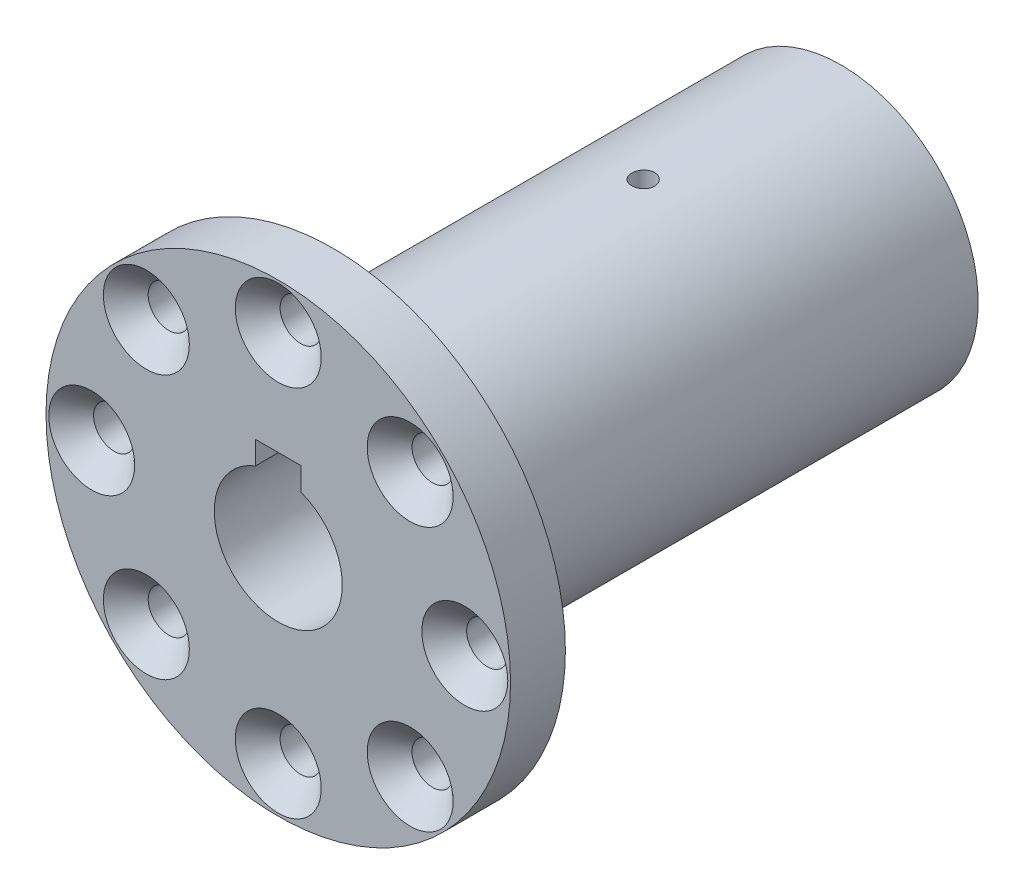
ISO-10303-21;
HEADER;
FILE_DESCRIPTION(('STEP AP214'),'2;1');
FILE_NAME('part.step','',(''),(''),'','','');
FILE_SCHEMA(('AUTOMOTIVE_DESIGN { 1 0 10303 214 1 1 1 1 }'));
ENDSEC;
DATA;
#1=APPLICATION_CONTEXT('core data for automotive mechanical design processes');
#2=APPLICATION_PROTOCOL_DEFINITION('international standard','automotive_design',2000,#1);
#3=PRODUCT_CONTEXT('',#1,'mechanical');
#4=PRODUCT('Part','Part','',(#3));
#5=PRODUCT_RELATED_PRODUCT_CATEGORY('part','',(#4));
#6=PRODUCT_DEFINITION_FORMATION('','',#4);
#7=PRODUCT_DEFINITION_CONTEXT('part definition',#1,'design');
#8=PRODUCT_DEFINITION('design','',#6,#7);
#9=PRODUCT_DEFINITION_SHAPE('','',#8);
#10=(LENGTH_UNIT() NAMED_UNIT(*) SI_UNIT(.MILLI.,.METRE.));
#11=(NAMED_UNIT(*) PLANE_ANGLE_UNIT() SI_UNIT($,.RADIAN.));
#12=(NAMED_UNIT(*) SI_UNIT($,.STERADIAN.) SOLID_ANGLE_UNIT());
#13=UNCERTAINTY_MEASURE_WITH_UNIT(LENGTH_MEASURE(1.E-05),#10,'distance_accuracy_value','');
#14=(GEOMETRIC_REPRESENTATION_CONTEXT(3) GLOBAL_UNCERTAINTY_ASSIGNED_CONTEXT((#13)) GLOBAL_UNIT_ASSIGNED_CONTEXT((#10,
#11,#12)) REPRESENTATION_CONTEXT('',''));
#15=CARTESIAN_POINT('',(0.,0.,0.));
#16=DIRECTION('',(0.,0.,1.));
#17=DIRECTION('',(1.,0.,0.));
#18=AXIS2_PLACEMENT_3D('',#15,#16,#17);
#19=CARTESIAN_POINT('',(0.,0.,61.54));
#20=DIRECTION('',(0.,0.,-1.));
#21=DIRECTION('',(-1.,0.,0.));
#22=AXIS2_PLACEMENT_3D('',#19,#20,#21);
#23=CYLINDRICAL_SURFACE('',#22,25.4);
#24=CARTESIAN_POINT('',(0.,0.,61.54));
#25=DIRECTION('',(0.,0.,-1.));
#26=DIRECTION('',(-1.,0.,0.));
#27=AXIS2_PLACEMENT_3D('',#24,#25,#26);
#28=CIRCLE('',#27,25.4);
#29=CARTESIAN_POINT('',(-25.4,0.,61.54));
#30=VERTEX_POINT('',#29);
#31=EDGE_CURVE('E11',#30,#30,#28,.T.);
#32=ORIENTED_EDGE('',*,*,#31,.T.);
#33=EDGE_LOOP('',(#32));
#34=FACE_BOUND('',#33,.T.);
#35=CARTESIAN_POINT('',(0.,0.,55.54));
#36=DIRECTION('',(0.,0.,-1.));
#37=DIRECTION('',(-1.,0.,0.));
#38=AXIS2_PLACEMENT_3D('',#35,#36,#37);
#39=CIRCLE('',#38,25.4);
#40=CARTESIAN_POINT('',(-25.4,0.,55.54));
#41=VERTEX_POINT('',#40);
#42=EDGE_CURVE('E41',#41,#41,#39,.T.);
#43=ORIENTED_EDGE('',*,*,#42,.F.);
#44=EDGE_LOOP('',(#43));
#45=FACE_BOUND('',#44,.T.);
#46=ADVANCED_FACE('F33',(#34,#45),#23,.T.);
#47=CARTESIAN_POINT('',(25.4,0.,61.54));
#48=DIRECTION('',(0.,0.,1.));
#49=DIRECTION('',(1.,0.,0.));
#50=AXIS2_PLACEMENT_3D('',#47,#48,#49);
#51=PLANE('',#50);
#52=CARTESIAN_POINT('',(0.,20.4,61.54));
#53=DIRECTION('',(0.,0.,1.));
#54=DIRECTION('',(1.,0.,0.));
#55=AXIS2_PLACEMENT_3D('',#52,#53,#54);
#56=CIRCLE('',#55,4.70000000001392);
#57=CARTESIAN_POINT('',(4.70000000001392,20.4,61.54));
#58=VERTEX_POINT('',#57);
#59=EDGE_CURVE('E368',#58,#58,#56,.T.);
#60=ORIENTED_EDGE('',*,*,#59,.F.);
#61=EDGE_LOOP('',(#60));
#62=FACE_BOUND('',#61,.T.);
#63=CARTESIAN_POINT('',(14.4249783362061,14.4249783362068,61.54));
#64=DIRECTION('',(0.,0.,1.));
#65=DIRECTION('',(1.,0.,0.));
#66=AXIS2_PLACEMENT_3D('',#63,#64,#65);
#67=CIRCLE('',#66,4.70000000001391);
#68=CARTESIAN_POINT('',(19.12497833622,14.4249783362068,61.54));
#69=VERTEX_POINT('',#68);
#70=EDGE_CURVE('E362',#69,#69,#67,.T.);
#71=ORIENTED_EDGE('',*,*,#70,.F.);
#72=EDGE_LOOP('',(#71));
#73=FACE_BOUND('',#72,.T.);
#74=CARTESIAN_POINT('',(20.4000000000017,1.73691033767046E-12,61.54));
#75=DIRECTION('',(0.,0.,1.));
#76=DIRECTION('',(1.,0.,0.));
#77=AXIS2_PLACEMENT_3D('',#74,#75,#76);
#78=CIRCLE('',#77,4.70000000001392);
#79=CARTESIAN_POINT('',(25.1000000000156,1.73691033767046E-12,61.54));
#80=VERTEX_POINT('',#79);
#81=EDGE_CURVE('E356',#80,#80,#78,.T.);
#82=ORIENTED_EDGE('',*,*,#81,.F.);
#83=EDGE_LOOP('',(#82));
#84=FACE_BOUND('',#83,.T.);
#85=CARTESIAN_POINT('',(14.4249783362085,-14.4249783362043,61.54));
#86=DIRECTION('',(0.,0.,1.));
#87=DIRECTION('',(1.,0.,0.));
#88=AXIS2_PLACEMENT_3D('',#85,#86,#87);
#89=CIRCLE('',#88,4.70000000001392);
#90=CARTESIAN_POINT('',(19.1249783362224,-14.4249783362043,61.54));
#91=VERTEX_POINT('',#90);
#92=EDGE_CURVE('E350',#91,#91,#89,.T.);
#93=ORIENTED_EDGE('',*,*,#92,.F.);
#94=EDGE_LOOP('',(#93));
#95=FACE_BOUND('',#94,.T.);
#96=CARTESIAN_POINT('',(3.47378376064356E-12,-20.4,61.54));
#97=DIRECTION('',(0.,0.,1.));
#98=DIRECTION('',(1.,0.,0.));
#99=AXIS2_PLACEMENT_3D('',#96,#97,#98);
#100=CIRCLE('',#99,4.70000000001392);
#101=CARTESIAN_POINT('',(4.70000000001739,-20.4,61.54));
#102=VERTEX_POINT('',#101);
#103=EDGE_CURVE('E344',#102,#102,#100,.T.);
#104=ORIENTED_EDGE('',*,*,#103,.F.);
#105=EDGE_LOOP('',(#104));
#106=FACE_BOUND('',#105,.T.);
#107=CARTESIAN_POINT('',(-14.4249783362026,-14.4249783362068,61.54));
#108=DIRECTION('',(0.,0.,1.));
#109=DIRECTION('',(1.,0.,0.));
#110=AXIS2_PLACEMENT_3D('',#107,#108,#109);
#111=CIRCLE('',#110,4.70000000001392);
#112=CARTESIAN_POINT('',(-9.72497833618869,-14.4249783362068,61.54));
#113=VERTEX_POINT('',#112);
#114=EDGE_CURVE('E338',#113,#113,#111,.T.);
#115=ORIENTED_EDGE('',*,*,#114,.F.);
#116=EDGE_LOOP('',(#115));
#117=FACE_BOUND('',#116,.T.);
#118=CARTESIAN_POINT('',(-20.3999999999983,-1.73940861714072E-12,61.54));
#119=DIRECTION('',(0.,0.,1.));
#120=DIRECTION('',(1.,0.,0.));
#121=AXIS2_PLACEMENT_3D('',#118,#119,#120);
#122=CIRCLE('',#121,4.70000000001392);
#123=CARTESIAN_POINT('',(-15.6999999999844,-1.73940861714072E-12,61.54));
#124=VERTEX_POINT('',#123);
#125=EDGE_CURVE('E332',#124,#124,#122,.T.);
#126=ORIENTED_EDGE('',*,*,#125,.F.);
#127=EDGE_LOOP('',(#126));
#128=FACE_BOUND('',#127,.T.);
#129=CARTESIAN_POINT('',(-14.4249783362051,14.4249783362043,61.54));
#130=DIRECTION('',(0.,0.,1.));
#131=DIRECTION('',(1.,0.,0.));
#132=AXIS2_PLACEMENT_3D('',#129,#130,#131);
#133=CIRCLE('',#132,4.70000000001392);
#134=CARTESIAN_POINT('',(-9.72497833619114,14.4249783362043,61.54));
#135=VERTEX_POINT('',#134);
#136=EDGE_CURVE('E260',#135,#135,#133,.T.);
#137=ORIENTED_EDGE('',*,*,#136,.F.);
#138=EDGE_LOOP('',(#137));
#139=FACE_BOUND('',#138,.T.);
#140=CARTESIAN_POINT('',(0.,0.,61.54));
#141=DIRECTION('',(0.,0.,-1.));
#142=DIRECTION('',(-1.,0.,0.));
#143=AXIS2_PLACEMENT_3D('',#140,#141,#142);
#144=CIRCLE('',#143,7.);
#145=CARTESIAN_POINT('',(2.5,6.53834841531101,61.54));
#146=VERTEX_POINT('',#145);
#147=CARTESIAN_POINT('',(-2.5,6.53834841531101,61.54));
#148=VERTEX_POINT('',#147);
#149=EDGE_CURVE('E84',#146,#148,#144,.T.);
#150=ORIENTED_EDGE('',*,*,#149,.T.);
#151=DIRECTION('',(0.,1.,0.));
#152=VECTOR('',#151,1.);
#153=CARTESIAN_POINT('',(-2.5,6.53834841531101,61.54));
#154=LINE('',#153,#152);
#155=CARTESIAN_POINT('',(-2.5,9.05849989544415,61.54));
#156=VERTEX_POINT('',#155);
#157=EDGE_CURVE('E90',#148,#156,#154,.T.);
#158=ORIENTED_EDGE('',*,*,#157,.T.);
#159=DIRECTION('',(1.,0.,0.));
#160=VECTOR('',#159,1.);
#161=CARTESIAN_POINT('',(-2.5,9.05849989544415,61.54));
#162=LINE('',#161,#160);
#163=CARTESIAN_POINT('',(2.5,9.05849989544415,61.54));
#164=VERTEX_POINT('',#163);
#165=EDGE_CURVE('E302',#156,#164,#162,.T.);
#166=ORIENTED_EDGE('',*,*,#165,.T.);
#167=DIRECTION('',(0.,-1.,0.));
#168=VECTOR('',#167,1.);
#169=CARTESIAN_POINT('',(2.5,9.05849989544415,61.54));
#170=LINE('',#169,#168);
#171=EDGE_CURVE('E49',#164,#146,#170,.T.);
#172=ORIENTED_EDGE('',*,*,#171,.T.);
#173=EDGE_LOOP('',(#150,#158,#166,#172));
#174=FACE_BOUND('',#173,.T.);
#175=ORIENTED_EDGE('',*,*,#31,.F.);
#176=EDGE_LOOP('',(#175));
#177=FACE_BOUND('',#176,.T.);
#178=ADVANCED_FACE('F209',(#62,#73,#84,#95,#106,#117,#128,#139,#174,#177),#51,.T.);
#179=CARTESIAN_POINT('',(0.,0.,55.54));
#180=DIRECTION('',(0.,0.,-1.));
#181=DIRECTION('',(-1.,0.,0.));
#182=AXIS2_PLACEMENT_3D('',#179,#180,#181);
#183=PLANE('',#182);
#184=CARTESIAN_POINT('',(0.,20.4,55.54));
#185=DIRECTION('',(0.,0.,-1.));
#186=DIRECTION('',(-1.,0.,0.));
#187=AXIS2_PLACEMENT_3D('',#184,#185,#186);
#188=CIRCLE('',#187,2.24999999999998);
#189=CARTESIAN_POINT('',(-2.24999999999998,20.4,55.54));
#190=VERTEX_POINT('',#189);
#191=EDGE_CURVE('E36',#190,#190,#188,.T.);
#192=ORIENTED_EDGE('',*,*,#191,.F.);
#193=EDGE_LOOP('',(#192));
#194=FACE_BOUND('',#193,.T.);
#195=CARTESIAN_POINT('',(14.4249783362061,14.4249783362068,55.54));
#196=DIRECTION('',(0.,0.,-1.));
#197=DIRECTION('',(-1.,0.,0.));
#198=AXIS2_PLACEMENT_3D('',#195,#196,#197);
#199=CIRCLE('',#198,2.24999999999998);
#200=CARTESIAN_POINT('',(12.1749783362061,14.4249783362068,55.54));
#201=VERTEX_POINT('',#200);
#202=EDGE_CURVE('E229',#201,#201,#199,.T.);
#203=ORIENTED_EDGE('',*,*,#202,.F.);
#204=EDGE_LOOP('',(#203));
#205=FACE_BOUND('',#204,.T.);
#206=CARTESIAN_POINT('',(20.4000000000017,1.73691033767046E-12,55.54));
#207=DIRECTION('',(0.,0.,-1.));
#208=DIRECTION('',(-1.,0.,0.));
#209=AXIS2_PLACEMENT_3D('',#206,#207,#208);
#210=CIRCLE('',#209,2.24999999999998);
#211=CARTESIAN_POINT('',(18.1500000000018,1.73691033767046E-12,55.54));
#212=VERTEX_POINT('',#211);
#213=EDGE_CURVE('E233',#212,#212,#210,.T.);
#214=ORIENTED_EDGE('',*,*,#213,.F.);
#215=EDGE_LOOP('',(#214));
#216=FACE_BOUND('',#215,.T.);
#217=CARTESIAN_POINT('',(14.4249783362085,-14.4249783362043,55.54));
#218=DIRECTION('',(0.,0.,-1.));
#219=DIRECTION('',(-1.,0.,0.));
#220=AXIS2_PLACEMENT_3D('',#217,#218,#219);
#221=CIRCLE('',#220,2.24999999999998);
#222=CARTESIAN_POINT('',(12.1749783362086,-14.4249783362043,55.54));
#223=VERTEX_POINT('',#222);
#224=EDGE_CURVE('E237',#223,#223,#221,.T.);
#225=ORIENTED_EDGE('',*,*,#224,.F.);
#226=EDGE_LOOP('',(#225));
#227=FACE_BOUND('',#226,.T.);
#228=CARTESIAN_POINT('',(3.47378376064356E-12,-20.4,55.54));
#229=DIRECTION('',(0.,0.,-1.));
#230=DIRECTION('',(-1.,0.,0.));
#231=AXIS2_PLACEMENT_3D('',#228,#229,#230);
#232=CIRCLE('',#231,2.24999999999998);
#233=CARTESIAN_POINT('',(-2.2499999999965,-20.4,55.54));
#234=VERTEX_POINT('',#233);
#235=EDGE_CURVE('E241',#234,#234,#232,.T.);
#236=ORIENTED_EDGE('',*,*,#235,.F.);
#237=EDGE_LOOP('',(#236));
#238=FACE_BOUND('',#237,.T.);
#239=CARTESIAN_POINT('',(-14.4249783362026,-14.4249783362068,55.54));
#240=DIRECTION('',(0.,0.,-1.));
#241=DIRECTION('',(-1.,0.,0.));
#242=AXIS2_PLACEMENT_3D('',#239,#240,#241);
#243=CIRCLE('',#242,2.24999999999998);
#244=CARTESIAN_POINT('',(-16.6749783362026,-14.4249783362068,55.54));
#245=VERTEX_POINT('',#244);
#246=EDGE_CURVE('E245',#245,#245,#243,.T.);
#247=ORIENTED_EDGE('',*,*,#246,.F.);
#248=EDGE_LOOP('',(#247));
#249=FACE_BOUND('',#248,.T.);
#250=CARTESIAN_POINT('',(-20.3999999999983,-1.73940861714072E-12,55.54));
#251=DIRECTION('',(0.,0.,-1.));
#252=DIRECTION('',(-1.,0.,0.));
#253=AXIS2_PLACEMENT_3D('',#250,#251,#252);
#254=CIRCLE('',#253,2.24999999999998);
#255=CARTESIAN_POINT('',(-22.6499999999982,-1.73940861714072E-12,55.54));
#256=VERTEX_POINT('',#255);
#257=EDGE_CURVE('E249',#256,#256,#254,.T.);
#258=ORIENTED_EDGE('',*,*,#257,.F.);
#259=EDGE_LOOP('',(#258));
#260=FACE_BOUND('',#259,.T.);
#261=CARTESIAN_POINT('',(-14.4249783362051,14.4249783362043,55.54));
#262=DIRECTION('',(0.,0.,-1.));
#263=DIRECTION('',(-1.,0.,0.));
#264=AXIS2_PLACEMENT_3D('',#261,#262,#263);
#265=CIRCLE('',#264,2.24999999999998);
#266=CARTESIAN_POINT('',(-16.674978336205,14.4249783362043,55.54));
#267=VERTEX_POINT('',#266);
#268=EDGE_CURVE('E127',#267,#267,#265,.T.);
#269=ORIENTED_EDGE('',*,*,#268,.F.);
#270=EDGE_LOOP('',(#269));
#271=FACE_BOUND('',#270,.T.);
#272=CARTESIAN_POINT('',(0.,0.,55.54));
#273=DIRECTION('',(0.,0.,-1.));
#274=DIRECTION('',(-1.,0.,0.));
#275=AXIS2_PLACEMENT_3D('',#272,#273,#274);
#276=CIRCLE('',#275,15.);
#277=CARTESIAN_POINT('',(-15.,0.,55.54));
#278=VERTEX_POINT('',#277);
#279=EDGE_CURVE('E91',#278,#278,#276,.T.);
#280=ORIENTED_EDGE('',*,*,#279,.F.);
#281=EDGE_LOOP('',(#280));
#282=FACE_BOUND('',#281,.T.);
#283=ORIENTED_EDGE('',*,*,#42,.T.);
#284=EDGE_LOOP('',(#283));
#285=FACE_BOUND('',#284,.T.);
#286=ADVANCED_FACE('F204',(#194,#205,#216,#227,#238,#249,#260,#271,#282,#285),#183,.T.);
#287=CARTESIAN_POINT('',(0.,0.,0.));
#288=DIRECTION('',(0.,0.,1.));
#289=DIRECTION('',(1.,0.,0.));
#290=AXIS2_PLACEMENT_3D('',#287,#288,#289);
#291=CYLINDRICAL_SURFACE('',#290,15.);
#292=CARTESIAN_POINT('',(0.,15.,20.39));
#293=CARTESIAN_POINT('',(0.0700826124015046,14.999999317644,20.3900030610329));
#294=CARTESIAN_POINT('',(0.140212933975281,14.9995036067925,20.3959137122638));
#295=CARTESIAN_POINT('',(0.278533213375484,14.9975737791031,20.4194054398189));
#296=CARTESIAN_POINT('',(0.346720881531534,14.9961385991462,20.4369997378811));
#297=CARTESIAN_POINT('',(0.479132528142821,14.9924920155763,20.4833464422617));
#298=CARTESIAN_POINT('',(0.543358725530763,14.9902810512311,20.5120925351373));
#299=CARTESIAN_POINT('',(0.666059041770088,14.9853308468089,20.57991553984));
#300=CARTESIAN_POINT('',(0.724534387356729,14.982591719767,20.6189902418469));
#301=CARTESIAN_POINT('',(0.83423749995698,14.9768847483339,20.7064688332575));
#302=CARTESIAN_POINT('',(0.885448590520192,14.9739164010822,20.7548936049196));
#303=CARTESIAN_POINT('',(0.979026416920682,14.9680897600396,20.8596536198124));
#304=CARTESIAN_POINT('',(1.02139276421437,14.965231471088,20.9159892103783));
#305=CARTESIAN_POINT('',(1.09613490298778,14.9599431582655,21.0350726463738));
#306=CARTESIAN_POINT('',(1.12849604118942,14.9575137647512,21.0978297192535));
#307=CARTESIAN_POINT('',(1.18221554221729,14.9533640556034,21.227910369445));
#308=CARTESIAN_POINT('',(1.20357409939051,14.9516437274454,21.2952338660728));
#309=CARTESIAN_POINT('',(1.2346337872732,14.949111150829,21.4323692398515));
#310=CARTESIAN_POINT('',(1.24436208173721,14.9482967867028,21.5021749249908));
#311=CARTESIAN_POINT('',(1.25196901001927,14.9476616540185,21.6424327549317));
#312=CARTESIAN_POINT('',(1.24984786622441,14.9478408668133,21.7128848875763));
#313=CARTESIAN_POINT('',(1.23383858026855,14.9491707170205,21.8522495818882));
#314=CARTESIAN_POINT('',(1.21997996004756,14.9503189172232,21.9211655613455));
#315=CARTESIAN_POINT('',(1.18093498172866,14.9534535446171,22.0556898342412));
#316=CARTESIAN_POINT('',(1.15574851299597,14.955439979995,22.1212980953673));
#317=CARTESIAN_POINT('',(1.09472973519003,14.9600300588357,22.2474386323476));
#318=CARTESIAN_POINT('',(1.05888418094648,14.9626344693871,22.3079644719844));
#319=CARTESIAN_POINT('',(0.977574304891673,14.9681663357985,22.4221516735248));
#320=CARTESIAN_POINT('',(0.932109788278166,14.9710937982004,22.4758128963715));
#321=CARTESIAN_POINT('',(0.832686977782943,14.9769527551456,22.5749192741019));
#322=CARTESIAN_POINT('',(0.778703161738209,14.9798842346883,22.6203388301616));
#323=CARTESIAN_POINT('',(0.66386319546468,14.9854123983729,22.7014746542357));
#324=CARTESIAN_POINT('',(0.603007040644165,14.9880090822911,22.7371909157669));
#325=CARTESIAN_POINT('',(0.476133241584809,14.9925755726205,22.7979047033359));
#326=CARTESIAN_POINT('',(0.410115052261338,14.9945453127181,22.8229010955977));
#327=CARTESIAN_POINT('',(0.274798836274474,14.9976352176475,22.8614476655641));
#328=CARTESIAN_POINT('',(0.205500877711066,14.9987554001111,22.8749980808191));
#329=CARTESIAN_POINT('',(0.065814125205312,15.0000177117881,22.890235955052));
#330=CARTESIAN_POINT('',(-0.00457078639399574,15.00016275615,22.8919587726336));
#331=CARTESIAN_POINT('',(-0.144628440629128,14.9994662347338,22.8835851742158));
#332=CARTESIAN_POINT('',(-0.214301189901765,14.9986246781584,22.8734888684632));
#333=CARTESIAN_POINT('',(-0.350855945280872,14.9960514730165,22.8417929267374));
#334=CARTESIAN_POINT('',(-0.417741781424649,14.9943210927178,22.8202096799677));
#335=CARTESIAN_POINT('',(-0.546942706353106,14.9901646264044,22.7661692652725));
#336=CARTESIAN_POINT('',(-0.60925772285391,14.9877385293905,22.7337119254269));
#337=CARTESIAN_POINT('',(-0.727709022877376,14.9824553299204,22.6587558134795));
#338=CARTESIAN_POINT('',(-0.783830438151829,14.9795972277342,22.6162336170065));
#339=CARTESIAN_POINT('',(-0.888151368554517,14.9737744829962,22.5223886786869));
#340=CARTESIAN_POINT('',(-0.93635074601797,14.9708098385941,22.4710657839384));
#341=CARTESIAN_POINT('',(-1.02358068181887,14.9650995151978,22.3609228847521));
#342=CARTESIAN_POINT('',(-1.06258816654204,14.9623543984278,22.3020845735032));
#343=CARTESIAN_POINT('',(-1.13016882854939,14.957401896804,22.1786721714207));
#344=CARTESIAN_POINT('',(-1.15874211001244,14.9551945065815,22.1140981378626));
#345=CARTESIAN_POINT('',(-1.20460397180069,14.9515705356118,21.9811290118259));
#346=CARTESIAN_POINT('',(-1.2219066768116,14.9501529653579,21.9127388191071));
#347=CARTESIAN_POINT('',(-1.24478221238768,14.9482658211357,21.774011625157));
#348=CARTESIAN_POINT('',(-1.25035526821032,14.9477962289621,21.703674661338));
#349=CARTESIAN_POINT('',(-1.24961070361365,14.9478584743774,21.5632798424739));
#350=CARTESIAN_POINT('',(-1.24332933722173,14.9483872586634,21.4932217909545));
#351=CARTESIAN_POINT('',(-1.21912982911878,14.9503801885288,21.3551593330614));
#352=CARTESIAN_POINT('',(-1.20121166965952,14.951844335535,21.2871549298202));
#353=CARTESIAN_POINT('',(-1.15425638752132,14.9555422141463,21.1551277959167));
#354=CARTESIAN_POINT('',(-1.12521991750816,14.9577759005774,21.0911048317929));
#355=CARTESIAN_POINT('',(-1.05685632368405,14.9627612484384,20.9688364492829));
#356=CARTESIAN_POINT('',(-1.01752936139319,14.9655129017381,20.9105909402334));
#357=CARTESIAN_POINT('',(-0.929564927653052,14.9712341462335,20.8013453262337));
#358=CARTESIAN_POINT('',(-0.880900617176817,14.9742043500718,20.7503668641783));
#359=CARTESIAN_POINT('',(-0.775691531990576,14.980022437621,20.6572810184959));
#360=CARTESIAN_POINT('',(-0.719144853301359,14.9828702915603,20.61517578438));
#361=CARTESIAN_POINT('',(-0.599667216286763,14.9881279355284,20.5409751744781));
#362=CARTESIAN_POINT('',(-0.536724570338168,14.9905369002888,20.5088985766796));
#363=CARTESIAN_POINT('',(-0.406369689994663,14.9946356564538,20.4558102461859));
#364=CARTESIAN_POINT('',(-0.33896269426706,14.9963262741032,20.4347857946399));
#365=CARTESIAN_POINT('',(-0.225965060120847,14.9983638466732,20.4097530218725));
#366=CARTESIAN_POINT('',(-0.181101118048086,14.9989746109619,20.4023554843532));
#367=CARTESIAN_POINT('',(-0.0908314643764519,14.9997929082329,20.3924779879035));
#368=CARTESIAN_POINT('',(-0.0454257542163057,15.0000004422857,20.3899980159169));
#369=CARTESIAN_POINT('',(0.,15.,20.39));
#370=B_SPLINE_CURVE_WITH_KNOTS('',3,(#292,#293,#294,#295,#296,#297,#298,#299,#300,#301,#302,
#303,#304,#305,#306,#307,#308,#309,#310,#311,#312,#313,#314,#315,#316,#317,#318,#319,#320,#321,
#322,#323,#324,#325,#326,#327,#328,#329,#330,#331,#332,#333,#334,#335,#336,#337,#338,#339,#340,
#341,#342,#343,#344,#345,#346,#347,#348,#349,#350,#351,#352,#353,#354,#355,#356,#357,#358,#359,
#360,#361,#362,#363,#364,#365,#366,#367,#368,#369),.UNSPECIFIED.,.T.,.F.,(4,2,2,2,2,2,2,2,2,2,2,
2,2,2,2,2,2,2,2,2,2,2,2,2,2,2,2,2,2,2,2,2,2,2,2,2,2,2,4),(0.,0.210081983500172,0.42040211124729,
0.630603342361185,0.840759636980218,1.05139083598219,1.26203128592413,1.47297878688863,
1.68392256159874,1.89437268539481,2.10481885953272,2.3147372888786,2.52465776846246,
2.73484019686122,2.94502688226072,3.15585563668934,3.36668453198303,3.57753571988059,
3.78838253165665,3.99859874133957,4.20881299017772,4.41872811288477,4.62864655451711,
4.83905843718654,5.04947397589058,5.26041220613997,5.4713483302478,5.68201959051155,
5.89268680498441,6.10271078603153,6.31273508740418,6.52274706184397,6.73275574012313,
6.94337735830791,7.15404994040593,7.36511466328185,7.57593595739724,7.7121060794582,
7.84827583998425),.UNSPECIFIED.);
#371=CARTESIAN_POINT('',(0.,15.,20.39));
#372=VERTEX_POINT('',#371);
#373=EDGE_CURVE('E118',#372,#372,#370,.T.);
#374=ORIENTED_EDGE('',*,*,#373,.T.);
#375=EDGE_LOOP('',(#374));
#376=FACE_BOUND('',#375,.T.);
#377=CARTESIAN_POINT('',(0.,0.,0.));
#378=DIRECTION('',(0.,0.,-1.));
#379=DIRECTION('',(-1.,0.,0.));
#380=AXIS2_PLACEMENT_3D('',#377,#378,#379);
#381=CIRCLE('',#380,15.);
#382=CARTESIAN_POINT('',(-15.,0.,0.));
#383=VERTEX_POINT('',#382);
#384=EDGE_CURVE('E111',#383,#383,#381,.T.);
#385=ORIENTED_EDGE('',*,*,#384,.F.);
#386=EDGE_LOOP('',(#385));
#387=FACE_BOUND('',#386,.T.);
#388=ORIENTED_EDGE('',*,*,#279,.T.);
#389=EDGE_LOOP('',(#388));
#390=FACE_BOUND('',#389,.T.);
#391=ADVANCED_FACE('F129',(#376,#387,#390),#291,.T.);
#392=CARTESIAN_POINT('',(0.,0.,0.));
#393=DIRECTION('',(0.,0.,-1.));
#394=DIRECTION('',(-1.,0.,0.));
#395=AXIS2_PLACEMENT_3D('',#392,#393,#394);
#396=PLANE('',#395);
#397=CARTESIAN_POINT('',(11.4999999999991,-7.61616736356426E-13,0.));
#398=DIRECTION('',(0.,0.,-1.));
#399=DIRECTION('',(-1.,0.,0.));
#400=AXIS2_PLACEMENT_3D('',#397,#398,#399);
#401=CIRCLE('',#400,1.24999999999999);
#402=CARTESIAN_POINT('',(10.2499999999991,-7.61616736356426E-13,0.));
#403=VERTEX_POINT('',#402);
#404=EDGE_CURVE('E125',#403,#403,#401,.T.);
#405=ORIENTED_EDGE('',*,*,#404,.F.);
#406=EDGE_LOOP('',(#405));
#407=FACE_BOUND('',#406,.T.);
#408=CARTESIAN_POINT('',(5.74999999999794,-9.95929214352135,0.));
#409=DIRECTION('',(0.,0.,-1.));
#410=DIRECTION('',(-1.,0.,0.));
#411=AXIS2_PLACEMENT_3D('',#408,#409,#410);
#412=CIRCLE('',#411,1.24999999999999);
#413=CARTESIAN_POINT('',(4.49999999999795,-9.95929214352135,0.));
#414=VERTEX_POINT('',#413);
#415=EDGE_CURVE('E273',#414,#414,#412,.T.);
#416=ORIENTED_EDGE('',*,*,#415,.F.);
#417=EDGE_LOOP('',(#416));
#418=FACE_BOUND('',#417,.T.);
#419=CARTESIAN_POINT('',(-5.75000000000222,-9.95929214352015,0.));
#420=DIRECTION('',(0.,0.,-1.));
#421=DIRECTION('',(-1.,0.,0.));
#422=AXIS2_PLACEMENT_3D('',#419,#420,#421);
#423=CIRCLE('',#422,1.24999999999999);
#424=CARTESIAN_POINT('',(-7.00000000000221,-9.95929214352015,0.));
#425=VERTEX_POINT('',#424);
#426=EDGE_CURVE('E279',#425,#425,#423,.T.);
#427=ORIENTED_EDGE('',*,*,#426,.F.);
#428=EDGE_LOOP('',(#427));
#429=FACE_BOUND('',#428,.T.);
#430=CARTESIAN_POINT('',(-11.5000000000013,1.64225995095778E-12,0.));
#431=DIRECTION('',(0.,0.,-1.));
#432=DIRECTION('',(-1.,0.,0.));
#433=AXIS2_PLACEMENT_3D('',#430,#431,#432);
#434=CIRCLE('',#433,1.24999999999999);
#435=CARTESIAN_POINT('',(-12.7500000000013,1.64225995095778E-12,0.));
#436=VERTEX_POINT('',#435);
#437=EDGE_CURVE('E285',#436,#436,#434,.T.);
#438=ORIENTED_EDGE('',*,*,#437,.F.);
#439=EDGE_LOOP('',(#438));
#440=FACE_BOUND('',#439,.T.);
#441=CARTESIAN_POINT('',(-5.75000000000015,9.95929214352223,0.));
#442=DIRECTION('',(0.,0.,-1.));
#443=DIRECTION('',(-1.,0.,0.));
#444=AXIS2_PLACEMENT_3D('',#441,#442,#443);
#445=CIRCLE('',#444,1.24999999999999);
#446=CARTESIAN_POINT('',(-7.00000000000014,9.95929214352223,0.));
#447=VERTEX_POINT('',#446);
#448=EDGE_CURVE('E291',#447,#447,#445,.T.);
#449=ORIENTED_EDGE('',*,*,#448,.F.);
#450=EDGE_LOOP('',(#449));
#451=FACE_BOUND('',#450,.T.);
#452=CARTESIAN_POINT('',(5.75000000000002,9.95929214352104,0.));
#453=DIRECTION('',(0.,0.,-1.));
#454=DIRECTION('',(-1.,0.,0.));
#455=AXIS2_PLACEMENT_3D('',#452,#453,#454);
#456=CIRCLE('',#455,1.24999999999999);
#457=CARTESIAN_POINT('',(4.50000000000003,9.95929214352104,0.));
#458=VERTEX_POINT('',#457);
#459=EDGE_CURVE('E297',#458,#458,#456,.T.);
#460=ORIENTED_EDGE('',*,*,#459,.F.);
#461=EDGE_LOOP('',(#460));
#462=FACE_BOUND('',#461,.T.);
#463=CARTESIAN_POINT('',(0.,0.,0.));
#464=DIRECTION('',(0.,0.,-1.));
#465=DIRECTION('',(-1.,0.,0.));
#466=AXIS2_PLACEMENT_3D('',#463,#464,#465);
#467=CIRCLE('',#466,7.);
#468=CARTESIAN_POINT('',(2.5,6.53834841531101,0.));
#469=VERTEX_POINT('',#468);
#470=CARTESIAN_POINT('',(-2.5,6.53834841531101,0.));
#471=VERTEX_POINT('',#470);
#472=EDGE_CURVE('E76',#469,#471,#467,.T.);
#473=ORIENTED_EDGE('',*,*,#472,.F.);
#474=DIRECTION('',(0.,-1.,0.));
#475=VECTOR('',#474,1.);
#476=CARTESIAN_POINT('',(2.5,9.05849989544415,0.));
#477=LINE('',#476,#475);
#478=CARTESIAN_POINT('',(2.5,9.05849989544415,0.));
#479=VERTEX_POINT('',#478);
#480=EDGE_CURVE('E99',#479,#469,#477,.T.);
#481=ORIENTED_EDGE('',*,*,#480,.F.);
#482=DIRECTION('',(1.,0.,0.));
#483=VECTOR('',#482,1.);
#484=CARTESIAN_POINT('',(-2.5,9.05849989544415,0.));
#485=LINE('',#484,#483);
#486=CARTESIAN_POINT('',(-2.5,9.05849989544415,0.));
#487=VERTEX_POINT('',#486);
#488=EDGE_CURVE('E97',#487,#479,#485,.T.);
#489=ORIENTED_EDGE('',*,*,#488,.F.);
#490=DIRECTION('',(0.,1.,0.));
#491=VECTOR('',#490,1.);
#492=CARTESIAN_POINT('',(-2.5,6.53834841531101,0.));
#493=LINE('',#492,#491);
#494=EDGE_CURVE('E57',#471,#487,#493,.T.);
#495=ORIENTED_EDGE('',*,*,#494,.F.);
#496=EDGE_LOOP('',(#473,#481,#489,#495));
#497=FACE_BOUND('',#496,.T.);
#498=ORIENTED_EDGE('',*,*,#384,.T.);
#499=EDGE_LOOP('',(#498));
#500=FACE_BOUND('',#499,.T.);
#501=ADVANCED_FACE('F94',(#407,#418,#429,#440,#451,#462,#497,#500),#396,.T.);
#502=CARTESIAN_POINT('',(-2.5,6.53834841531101,61.54));
#503=DIRECTION('',(-1.,0.,0.));
#504=DIRECTION('',(0.,0.,1.));
#505=AXIS2_PLACEMENT_3D('',#502,#503,#504);
#506=PLANE('',#505);
#507=ORIENTED_EDGE('',*,*,#494,.T.);
#508=DIRECTION('',(0.,0.,-1.));
#509=VECTOR('',#508,1.);
#510=CARTESIAN_POINT('',(-2.5,9.05849989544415,61.54));
#511=LINE('',#510,#509);
#512=EDGE_CURVE('E109',#156,#487,#511,.T.);
#513=ORIENTED_EDGE('',*,*,#512,.F.);
#514=ORIENTED_EDGE('',*,*,#157,.F.);
#515=DIRECTION('',(0.,0.,-1.));
#516=VECTOR('',#515,1.);
#517=CARTESIAN_POINT('',(-2.5,6.53834841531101,61.54));
#518=LINE('',#517,#516);
#519=EDGE_CURVE('E78',#148,#471,#518,.T.);
#520=ORIENTED_EDGE('',*,*,#519,.T.);
#521=EDGE_LOOP('',(#507,#513,#514,#520));
#522=FACE_BOUND('',#521,.T.);
#523=ADVANCED_FACE('F88',(#522),#506,.F.);
#524=CARTESIAN_POINT('',(2.5,9.05849989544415,61.54));
#525=DIRECTION('',(1.,0.,0.));
#526=DIRECTION('',(0.,1.,0.));
#527=AXIS2_PLACEMENT_3D('',#524,#525,#526);
#528=PLANE('',#527);
#529=ORIENTED_EDGE('',*,*,#480,.T.);
#530=DIRECTION('',(0.,0.,-1.));
#531=VECTOR('',#530,1.);
#532=CARTESIAN_POINT('',(2.5,6.53834841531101,61.54));
#533=LINE('',#532,#531);
#534=EDGE_CURVE('E80',#146,#469,#533,.T.);
#535=ORIENTED_EDGE('',*,*,#534,.F.);
#536=ORIENTED_EDGE('',*,*,#171,.F.);
#537=DIRECTION('',(0.,0.,-1.));
#538=VECTOR('',#537,1.);
#539=CARTESIAN_POINT('',(2.5,9.05849989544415,61.54));
#540=LINE('',#539,#538);
#541=EDGE_CURVE('E107',#164,#479,#540,.T.);
#542=ORIENTED_EDGE('',*,*,#541,.T.);
#543=EDGE_LOOP('',(#529,#535,#536,#542));
#544=FACE_BOUND('',#543,.T.);
#545=ADVANCED_FACE('F192',(#544),#528,.F.);
#546=CARTESIAN_POINT('',(-2.5,9.05849989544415,61.54));
#547=DIRECTION('',(0.,1.,0.));
#548=DIRECTION('',(0.,0.,1.));
#549=AXIS2_PLACEMENT_3D('',#546,#547,#548);
#550=PLANE('',#549);
#551=CARTESIAN_POINT('',(0.,9.05849989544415,21.64));
#552=DIRECTION('',(0.,-1.,0.));
#553=DIRECTION('',(0.,0.,-1.));
#554=AXIS2_PLACEMENT_3D('',#551,#552,#553);
#555=CIRCLE('',#554,1.24999999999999);
#556=CARTESIAN_POINT('',(0.,9.05849989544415,20.39));
#557=VERTEX_POINT('',#556);
#558=EDGE_CURVE('E126',#557,#557,#555,.T.);
#559=ORIENTED_EDGE('',*,*,#558,.F.);
#560=EDGE_LOOP('',(#559));
#561=FACE_BOUND('',#560,.T.);
#562=ORIENTED_EDGE('',*,*,#488,.T.);
#563=ORIENTED_EDGE('',*,*,#541,.F.);
#564=ORIENTED_EDGE('',*,*,#165,.F.);
#565=ORIENTED_EDGE('',*,*,#512,.T.);
#566=EDGE_LOOP('',(#562,#563,#564,#565));
#567=FACE_BOUND('',#566,.T.);
#568=ADVANCED_FACE('F191',(#561,#567),#550,.F.);
#569=CARTESIAN_POINT('',(0.,0.,61.54));
#570=DIRECTION('',(0.,0.,-1.));
#571=DIRECTION('',(-1.,0.,0.));
#572=AXIS2_PLACEMENT_3D('',#569,#570,#571);
#573=CYLINDRICAL_SURFACE('',#572,7.);
#574=ORIENTED_EDGE('',*,*,#149,.F.);
#575=ORIENTED_EDGE('',*,*,#534,.T.);
#576=ORIENTED_EDGE('',*,*,#472,.T.);
#577=ORIENTED_EDGE('',*,*,#519,.F.);
#578=EDGE_LOOP('',(#574,#575,#576,#577));
#579=FACE_BOUND('',#578,.T.);
#580=ADVANCED_FACE('F77',(#579),#573,.F.);
#581=CARTESIAN_POINT('',(5.75000000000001,9.95929214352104,12.));
#582=DIRECTION('',(0.,0.,1.));
#583=DIRECTION('',(1.,0.,0.));
#584=AXIS2_PLACEMENT_3D('',#581,#582,#583);
#585=PLANE('',#584);
#586=CARTESIAN_POINT('',(5.75000000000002,9.95929214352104,12.));
#587=DIRECTION('',(0.,0.,-1.));
#588=DIRECTION('',(-1.,0.,0.));
#589=AXIS2_PLACEMENT_3D('',#586,#587,#588);
#590=CIRCLE('',#589,1.24999999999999);
#591=CARTESIAN_POINT('',(4.50000000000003,9.95929214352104,12.));
#592=VERTEX_POINT('',#591);
#593=EDGE_CURVE('E85',#592,#592,#590,.T.);
#594=ORIENTED_EDGE('',*,*,#593,.T.);
#595=EDGE_LOOP('',(#594));
#596=FACE_BOUND('',#595,.T.);
#597=ADVANCED_FACE('F184',(#596),#585,.F.);
#598=CARTESIAN_POINT('',(5.75000000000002,9.95929214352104,0.));
#599=DIRECTION('',(0.,0.,-1.));
#600=DIRECTION('',(-1.,0.,0.));
#601=AXIS2_PLACEMENT_3D('',#598,#599,#600);
#602=CYLINDRICAL_SURFACE('',#601,1.24999999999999);
#603=ORIENTED_EDGE('',*,*,#593,.F.);
#604=EDGE_LOOP('',(#603));
#605=FACE_BOUND('',#604,.T.);
#606=ORIENTED_EDGE('',*,*,#459,.T.);
#607=EDGE_LOOP('',(#606));
#608=FACE_BOUND('',#607,.T.);
#609=ADVANCED_FACE('F180',(#605,#608),#602,.F.);
#610=CARTESIAN_POINT('',(-5.75000000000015,9.95929214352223,12.));
#611=DIRECTION('',(0.,0.,1.));
#612=DIRECTION('',(1.,0.,0.));
#613=AXIS2_PLACEMENT_3D('',#610,#611,#612);
#614=PLANE('',#613);
#615=CARTESIAN_POINT('',(-5.75000000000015,9.95929214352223,12.));
#616=DIRECTION('',(0.,0.,-1.));
#617=DIRECTION('',(-1.,0.,0.));
#618=AXIS2_PLACEMENT_3D('',#615,#616,#617);
#619=CIRCLE('',#618,1.24999999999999);
#620=CARTESIAN_POINT('',(-7.00000000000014,9.95929214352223,12.));
#621=VERTEX_POINT('',#620);
#622=EDGE_CURVE('E294',#621,#621,#619,.T.);
#623=ORIENTED_EDGE('',*,*,#622,.T.);
#624=EDGE_LOOP('',(#623));
#625=FACE_BOUND('',#624,.T.);
#626=ADVANCED_FACE('F176',(#625),#614,.F.);
#627=CARTESIAN_POINT('',(-5.75000000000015,9.95929214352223,0.));
#628=DIRECTION('',(0.,0.,-1.));
#629=DIRECTION('',(-1.,0.,0.));
#630=AXIS2_PLACEMENT_3D('',#627,#628,#629);
#631=CYLINDRICAL_SURFACE('',#630,1.24999999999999);
#632=ORIENTED_EDGE('',*,*,#622,.F.);
#633=EDGE_LOOP('',(#632));
#634=FACE_BOUND('',#633,.T.);
#635=ORIENTED_EDGE('',*,*,#448,.T.);
#636=EDGE_LOOP('',(#635));
#637=FACE_BOUND('',#636,.T.);
#638=ADVANCED_FACE('F172',(#634,#637),#631,.F.);
#639=CARTESIAN_POINT('',(-11.5000000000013,1.64225995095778E-12,12.));
#640=DIRECTION('',(0.,0.,1.));
#641=DIRECTION('',(1.,0.,0.));
#642=AXIS2_PLACEMENT_3D('',#639,#640,#641);
#643=PLANE('',#642);
#644=CARTESIAN_POINT('',(-11.5000000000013,1.64225995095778E-12,12.));
#645=DIRECTION('',(0.,0.,-1.));
#646=DIRECTION('',(-1.,0.,0.));
#647=AXIS2_PLACEMENT_3D('',#644,#645,#646);
#648=CIRCLE('',#647,1.24999999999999);
#649=CARTESIAN_POINT('',(-12.7500000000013,1.64225995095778E-12,12.));
#650=VERTEX_POINT('',#649);
#651=EDGE_CURVE('E288',#650,#650,#648,.T.);
#652=ORIENTED_EDGE('',*,*,#651,.T.);
#653=EDGE_LOOP('',(#652));
#654=FACE_BOUND('',#653,.T.);
#655=ADVANCED_FACE('F168',(#654),#643,.F.);
#656=CARTESIAN_POINT('',(-11.5000000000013,1.64225995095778E-12,0.));
#657=DIRECTION('',(0.,0.,-1.));
#658=DIRECTION('',(-1.,0.,0.));
#659=AXIS2_PLACEMENT_3D('',#656,#657,#658);
#660=CYLINDRICAL_SURFACE('',#659,1.24999999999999);
#661=ORIENTED_EDGE('',*,*,#651,.F.);
#662=EDGE_LOOP('',(#661));
#663=FACE_BOUND('',#662,.T.);
#664=ORIENTED_EDGE('',*,*,#437,.T.);
#665=EDGE_LOOP('',(#664));
#666=FACE_BOUND('',#665,.T.);
#667=ADVANCED_FACE('F164',(#663,#666),#660,.F.);
#668=CARTESIAN_POINT('',(-5.75000000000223,-9.95929214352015,12.));
#669=DIRECTION('',(0.,0.,1.));
#670=DIRECTION('',(1.,0.,0.));
#671=AXIS2_PLACEMENT_3D('',#668,#669,#670);
#672=PLANE('',#671);
#673=CARTESIAN_POINT('',(-5.75000000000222,-9.95929214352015,12.));
#674=DIRECTION('',(0.,0.,-1.));
#675=DIRECTION('',(-1.,0.,0.));
#676=AXIS2_PLACEMENT_3D('',#673,#674,#675);
#677=CIRCLE('',#676,1.24999999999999);
#678=CARTESIAN_POINT('',(-7.00000000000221,-9.95929214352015,12.));
#679=VERTEX_POINT('',#678);
#680=EDGE_CURVE('E282',#679,#679,#677,.T.);
#681=ORIENTED_EDGE('',*,*,#680,.T.);
#682=EDGE_LOOP('',(#681));
#683=FACE_BOUND('',#682,.T.);
#684=ADVANCED_FACE('F160',(#683),#672,.F.);
#685=CARTESIAN_POINT('',(-5.75000000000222,-9.95929214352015,0.));
#686=DIRECTION('',(0.,0.,-1.));
#687=DIRECTION('',(-1.,0.,0.));
#688=AXIS2_PLACEMENT_3D('',#685,#686,#687);
#689=CYLINDRICAL_SURFACE('',#688,1.24999999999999);
#690=ORIENTED_EDGE('',*,*,#680,.F.);
#691=EDGE_LOOP('',(#690));
#692=FACE_BOUND('',#691,.T.);
#693=ORIENTED_EDGE('',*,*,#426,.T.);
#694=EDGE_LOOP('',(#693));
#695=FACE_BOUND('',#694,.T.);
#696=ADVANCED_FACE('F156',(#692,#695),#689,.F.);
#697=CARTESIAN_POINT('',(5.74999999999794,-9.95929214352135,12.));
#698=DIRECTION('',(0.,0.,1.));
#699=DIRECTION('',(1.,0.,0.));
#700=AXIS2_PLACEMENT_3D('',#697,#698,#699);
#701=PLANE('',#700);
#702=CARTESIAN_POINT('',(5.74999999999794,-9.95929214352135,12.));
#703=DIRECTION('',(0.,0.,-1.));
#704=DIRECTION('',(-1.,0.,0.));
#705=AXIS2_PLACEMENT_3D('',#702,#703,#704);
#706=CIRCLE('',#705,1.24999999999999);
#707=CARTESIAN_POINT('',(4.49999999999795,-9.95929214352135,12.));
#708=VERTEX_POINT('',#707);
#709=EDGE_CURVE('E276',#708,#708,#706,.T.);
#710=ORIENTED_EDGE('',*,*,#709,.T.);
#711=EDGE_LOOP('',(#710));
#712=FACE_BOUND('',#711,.T.);
#713=ADVANCED_FACE('F152',(#712),#701,.F.);
#714=CARTESIAN_POINT('',(5.74999999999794,-9.95929214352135,0.));
#715=DIRECTION('',(0.,0.,-1.));
#716=DIRECTION('',(-1.,0.,0.));
#717=AXIS2_PLACEMENT_3D('',#714,#715,#716);
#718=CYLINDRICAL_SURFACE('',#717,1.24999999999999);
#719=ORIENTED_EDGE('',*,*,#709,.F.);
#720=EDGE_LOOP('',(#719));
#721=FACE_BOUND('',#720,.T.);
#722=ORIENTED_EDGE('',*,*,#415,.T.);
#723=EDGE_LOOP('',(#722));
#724=FACE_BOUND('',#723,.T.);
#725=ADVANCED_FACE('F148',(#721,#724),#718,.F.);
#726=CARTESIAN_POINT('',(11.4999999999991,-7.61616736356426E-13,12.));
#727=DIRECTION('',(0.,0.,1.));
#728=DIRECTION('',(1.,0.,0.));
#729=AXIS2_PLACEMENT_3D('',#726,#727,#728);
#730=PLANE('',#729);
#731=CARTESIAN_POINT('',(11.4999999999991,-7.61616736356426E-13,12.));
#732=DIRECTION('',(0.,0.,-1.));
#733=DIRECTION('',(-1.,0.,0.));
#734=AXIS2_PLACEMENT_3D('',#731,#732,#733);
#735=CIRCLE('',#734,1.24999999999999);
#736=CARTESIAN_POINT('',(10.2499999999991,-7.61616736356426E-13,12.));
#737=VERTEX_POINT('',#736);
#738=EDGE_CURVE('E270',#737,#737,#735,.T.);
#739=ORIENTED_EDGE('',*,*,#738,.T.);
#740=EDGE_LOOP('',(#739));
#741=FACE_BOUND('',#740,.T.);
#742=ADVANCED_FACE('F144',(#741),#730,.F.);
#743=CARTESIAN_POINT('',(11.4999999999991,-7.61616736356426E-13,0.));
#744=DIRECTION('',(0.,0.,-1.));
#745=DIRECTION('',(-1.,0.,0.));
#746=AXIS2_PLACEMENT_3D('',#743,#744,#745);
#747=CYLINDRICAL_SURFACE('',#746,1.24999999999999);
#748=ORIENTED_EDGE('',*,*,#738,.F.);
#749=EDGE_LOOP('',(#748));
#750=FACE_BOUND('',#749,.T.);
#751=ORIENTED_EDGE('',*,*,#404,.T.);
#752=EDGE_LOOP('',(#751));
#753=FACE_BOUND('',#752,.T.);
#754=ADVANCED_FACE('F139',(#750,#753),#747,.F.);
#755=CARTESIAN_POINT('',(0.,9.05849989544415,21.64));
#756=DIRECTION('',(0.,-1.,0.));
#757=DIRECTION('',(0.,0.,-1.));
#758=AXIS2_PLACEMENT_3D('',#755,#756,#757);
#759=CYLINDRICAL_SURFACE('',#758,1.24999999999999);
#760=ORIENTED_EDGE('',*,*,#558,.T.);
#761=EDGE_LOOP('',(#760));
#762=FACE_BOUND('',#761,.T.);
#763=ORIENTED_EDGE('',*,*,#373,.F.);
#764=EDGE_LOOP('',(#763));
#765=FACE_BOUND('',#764,.T.);
#766=ADVANCED_FACE('F133',(#762,#765),#759,.F.);
#767=CARTESIAN_POINT('',(-14.4249783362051,14.4249783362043,61.54));
#768=DIRECTION('',(0.,0.,1.));
#769=DIRECTION('',(1.,0.,0.));
#770=AXIS2_PLACEMENT_3D('',#767,#768,#769);
#771=CYLINDRICAL_SURFACE('',#770,2.24999999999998);
#772=ORIENTED_EDGE('',*,*,#268,.T.);
#773=EDGE_LOOP('',(#772));
#774=FACE_BOUND('',#773,.T.);
#775=CARTESIAN_POINT('',(-14.4249783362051,14.4249783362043,59.0899999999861));
#776=DIRECTION('',(0.,0.,1.));
#777=DIRECTION('',(1.,0.,0.));
#778=AXIS2_PLACEMENT_3D('',#775,#776,#777);
#779=CIRCLE('',#778,2.24999999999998);
#780=CARTESIAN_POINT('',(-12.1749783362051,14.4249783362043,59.0899999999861));
#781=VERTEX_POINT('',#780);
#782=EDGE_CURVE('E256',#781,#781,#779,.T.);
#783=ORIENTED_EDGE('',*,*,#782,.T.);
#784=EDGE_LOOP('',(#783));
#785=FACE_BOUND('',#784,.T.);
#786=ADVANCED_FACE('F138',(#774,#785),#771,.F.);
#787=CARTESIAN_POINT('',(-14.4249783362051,14.4249783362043,61.54));
#788=DIRECTION('',(0.,0.,1.));
#789=DIRECTION('',(1.,0.,0.));
#790=AXIS2_PLACEMENT_3D('',#787,#788,#789);
#791=CONICAL_SURFACE('',#790,4.70000000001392,0.785398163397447);
#792=ORIENTED_EDGE('',*,*,#782,.F.);
#793=EDGE_LOOP('',(#792));
#794=FACE_BOUND('',#793,.T.);
#795=ORIENTED_EDGE('',*,*,#136,.T.);
#796=EDGE_LOOP('',(#795));
#797=FACE_BOUND('',#796,.T.);
#798=ADVANCED_FACE('F388',(#794,#797),#791,.F.);
#799=CARTESIAN_POINT('',(-20.3999999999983,-1.73940861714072E-12,61.54));
#800=DIRECTION('',(0.,0.,1.));
#801=DIRECTION('',(1.,0.,0.));
#802=AXIS2_PLACEMENT_3D('',#799,#800,#801);
#803=CYLINDRICAL_SURFACE('',#802,2.24999999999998);
#804=ORIENTED_EDGE('',*,*,#257,.T.);
#805=EDGE_LOOP('',(#804));
#806=FACE_BOUND('',#805,.T.);
#807=CARTESIAN_POINT('',(-20.3999999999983,-1.73940861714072E-12,59.0899999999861));
#808=DIRECTION('',(0.,0.,1.));
#809=DIRECTION('',(1.,0.,0.));
#810=AXIS2_PLACEMENT_3D('',#807,#808,#809);
#811=CIRCLE('',#810,2.24999999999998);
#812=CARTESIAN_POINT('',(-18.1499999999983,-1.73940861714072E-12,59.0899999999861));
#813=VERTEX_POINT('',#812);
#814=EDGE_CURVE('E329',#813,#813,#811,.T.);
#815=ORIENTED_EDGE('',*,*,#814,.T.);
#816=EDGE_LOOP('',(#815));
#817=FACE_BOUND('',#816,.T.);
#818=ADVANCED_FACE('F390',(#806,#817),#803,.F.);
#819=CARTESIAN_POINT('',(-20.3999999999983,-1.73940861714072E-12,61.54));
#820=DIRECTION('',(0.,0.,1.));
#821=DIRECTION('',(1.,0.,0.));
#822=AXIS2_PLACEMENT_3D('',#819,#820,#821);
#823=CONICAL_SURFACE('',#822,4.70000000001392,0.785398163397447);
#824=ORIENTED_EDGE('',*,*,#814,.F.);
#825=EDGE_LOOP('',(#824));
#826=FACE_BOUND('',#825,.T.);
#827=ORIENTED_EDGE('',*,*,#125,.T.);
#828=EDGE_LOOP('',(#827));
#829=FACE_BOUND('',#828,.T.);
#830=ADVANCED_FACE('F396',(#826,#829),#823,.F.);
#831=CARTESIAN_POINT('',(-14.4249783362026,-14.4249783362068,61.54));
#832=DIRECTION('',(0.,0.,1.));
#833=DIRECTION('',(1.,0.,0.));
#834=AXIS2_PLACEMENT_3D('',#831,#832,#833);
#835=CYLINDRICAL_SURFACE('',#834,2.24999999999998);
#836=ORIENTED_EDGE('',*,*,#246,.T.);
#837=EDGE_LOOP('',(#836));
#838=FACE_BOUND('',#837,.T.);
#839=CARTESIAN_POINT('',(-14.4249783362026,-14.4249783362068,59.0899999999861));
#840=DIRECTION('',(0.,0.,1.));
#841=DIRECTION('',(1.,0.,0.));
#842=AXIS2_PLACEMENT_3D('',#839,#840,#841);
#843=CIRCLE('',#842,2.24999999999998);
#844=CARTESIAN_POINT('',(-12.1749783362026,-14.4249783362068,59.0899999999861));
#845=VERTEX_POINT('',#844);
#846=EDGE_CURVE('E335',#845,#845,#843,.T.);
#847=ORIENTED_EDGE('',*,*,#846,.T.);
#848=EDGE_LOOP('',(#847));
#849=FACE_BOUND('',#848,.T.);
#850=ADVANCED_FACE('F402',(#838,#849),#835,.F.);
#851=CARTESIAN_POINT('',(-14.4249783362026,-14.4249783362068,61.54));
#852=DIRECTION('',(0.,0.,1.));
#853=DIRECTION('',(1.,0.,0.));
#854=AXIS2_PLACEMENT_3D('',#851,#852,#853);
#855=CONICAL_SURFACE('',#854,4.70000000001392,0.785398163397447);
#856=ORIENTED_EDGE('',*,*,#846,.F.);
#857=EDGE_LOOP('',(#856));
#858=FACE_BOUND('',#857,.T.);
#859=ORIENTED_EDGE('',*,*,#114,.T.);
#860=EDGE_LOOP('',(#859));
#861=FACE_BOUND('',#860,.T.);
#862=ADVANCED_FACE('F406',(#858,#861),#855,.F.);
#863=CARTESIAN_POINT('',(3.47378376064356E-12,-20.4,61.54));
#864=DIRECTION('',(0.,0.,1.));
#865=DIRECTION('',(1.,0.,0.));
#866=AXIS2_PLACEMENT_3D('',#863,#864,#865);
#867=CYLINDRICAL_SURFACE('',#866,2.24999999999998);
#868=ORIENTED_EDGE('',*,*,#235,.T.);
#869=EDGE_LOOP('',(#868));
#870=FACE_BOUND('',#869,.T.);
#871=CARTESIAN_POINT('',(3.47378376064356E-12,-20.4,59.0899999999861));
#872=DIRECTION('',(0.,0.,1.));
#873=DIRECTION('',(1.,0.,0.));
#874=AXIS2_PLACEMENT_3D('',#871,#872,#873);
#875=CIRCLE('',#874,2.24999999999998);
#876=CARTESIAN_POINT('',(2.25000000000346,-20.4,59.0899999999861));
#877=VERTEX_POINT('',#876);
#878=EDGE_CURVE('E341',#877,#877,#875,.T.);
#879=ORIENTED_EDGE('',*,*,#878,.T.);
#880=EDGE_LOOP('',(#879));
#881=FACE_BOUND('',#880,.T.);
#882=ADVANCED_FACE('F410',(#870,#881),#867,.F.);
#883=CARTESIAN_POINT('',(3.47378376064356E-12,-20.4,61.54));
#884=DIRECTION('',(0.,0.,1.));
#885=DIRECTION('',(1.,0.,0.));
#886=AXIS2_PLACEMENT_3D('',#883,#884,#885);
#887=CONICAL_SURFACE('',#886,4.70000000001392,0.785398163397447);
#888=ORIENTED_EDGE('',*,*,#878,.F.);
#889=EDGE_LOOP('',(#888));
#890=FACE_BOUND('',#889,.T.);
#891=ORIENTED_EDGE('',*,*,#103,.T.);
#892=EDGE_LOOP('',(#891));
#893=FACE_BOUND('',#892,.T.);
#894=ADVANCED_FACE('F414',(#890,#893),#887,.F.);
#895=CARTESIAN_POINT('',(14.4249783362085,-14.4249783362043,61.54));
#896=DIRECTION('',(0.,0.,1.));
#897=DIRECTION('',(1.,0.,0.));
#898=AXIS2_PLACEMENT_3D('',#895,#896,#897);
#899=CYLINDRICAL_SURFACE('',#898,2.24999999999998);
#900=ORIENTED_EDGE('',*,*,#224,.T.);
#901=EDGE_LOOP('',(#900));
#902=FACE_BOUND('',#901,.T.);
#903=CARTESIAN_POINT('',(14.4249783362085,-14.4249783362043,59.0899999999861));
#904=DIRECTION('',(0.,0.,1.));
#905=DIRECTION('',(1.,0.,0.));
#906=AXIS2_PLACEMENT_3D('',#903,#904,#905);
#907=CIRCLE('',#906,2.24999999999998);
#908=CARTESIAN_POINT('',(16.6749783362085,-14.4249783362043,59.0899999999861));
#909=VERTEX_POINT('',#908);
#910=EDGE_CURVE('E347',#909,#909,#907,.T.);
#911=ORIENTED_EDGE('',*,*,#910,.T.);
#912=EDGE_LOOP('',(#911));
#913=FACE_BOUND('',#912,.T.);
#914=ADVANCED_FACE('F418',(#902,#913),#899,.F.);
#915=CARTESIAN_POINT('',(14.4249783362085,-14.4249783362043,61.54));
#916=DIRECTION('',(0.,0.,1.));
#917=DIRECTION('',(1.,0.,0.));
#918=AXIS2_PLACEMENT_3D('',#915,#916,#917);
#919=CONICAL_SURFACE('',#918,4.70000000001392,0.785398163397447);
#920=ORIENTED_EDGE('',*,*,#910,.F.);
#921=EDGE_LOOP('',(#920));
#922=FACE_BOUND('',#921,.T.);
#923=ORIENTED_EDGE('',*,*,#92,.T.);
#924=EDGE_LOOP('',(#923));
#925=FACE_BOUND('',#924,.T.);
#926=ADVANCED_FACE('F422',(#922,#925),#919,.F.);
#927=CARTESIAN_POINT('',(20.4000000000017,1.73691033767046E-12,61.54));
#928=DIRECTION('',(0.,0.,1.));
#929=DIRECTION('',(1.,0.,0.));
#930=AXIS2_PLACEMENT_3D('',#927,#928,#929);
#931=CYLINDRICAL_SURFACE('',#930,2.24999999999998);
#932=ORIENTED_EDGE('',*,*,#213,.T.);
#933=EDGE_LOOP('',(#932));
#934=FACE_BOUND('',#933,.T.);
#935=CARTESIAN_POINT('',(20.4000000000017,1.73691033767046E-12,59.0899999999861));
#936=DIRECTION('',(0.,0.,1.));
#937=DIRECTION('',(1.,0.,0.));
#938=AXIS2_PLACEMENT_3D('',#935,#936,#937);
#939=CIRCLE('',#938,2.24999999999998);
#940=CARTESIAN_POINT('',(22.6500000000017,1.73691033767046E-12,59.0899999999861));
#941=VERTEX_POINT('',#940);
#942=EDGE_CURVE('E353',#941,#941,#939,.T.);
#943=ORIENTED_EDGE('',*,*,#942,.T.);
#944=EDGE_LOOP('',(#943));
#945=FACE_BOUND('',#944,.T.);
#946=ADVANCED_FACE('F426',(#934,#945),#931,.F.);
#947=CARTESIAN_POINT('',(20.4000000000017,1.73691033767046E-12,61.54));
#948=DIRECTION('',(0.,0.,1.));
#949=DIRECTION('',(1.,0.,0.));
#950=AXIS2_PLACEMENT_3D('',#947,#948,#949);
#951=CONICAL_SURFACE('',#950,4.70000000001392,0.785398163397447);
#952=ORIENTED_EDGE('',*,*,#942,.F.);
#953=EDGE_LOOP('',(#952));
#954=FACE_BOUND('',#953,.T.);
#955=ORIENTED_EDGE('',*,*,#81,.T.);
#956=EDGE_LOOP('',(#955));
#957=FACE_BOUND('',#956,.T.);
#958=ADVANCED_FACE('F430',(#954,#957),#951,.F.);
#959=CARTESIAN_POINT('',(14.4249783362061,14.4249783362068,61.54));
#960=DIRECTION('',(0.,0.,1.));
#961=DIRECTION('',(1.,0.,0.));
#962=AXIS2_PLACEMENT_3D('',#959,#960,#961);
#963=CYLINDRICAL_SURFACE('',#962,2.24999999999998);
#964=ORIENTED_EDGE('',*,*,#202,.T.);
#965=EDGE_LOOP('',(#964));
#966=FACE_BOUND('',#965,.T.);
#967=CARTESIAN_POINT('',(14.4249783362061,14.4249783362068,59.0899999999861));
#968=DIRECTION('',(0.,0.,1.));
#969=DIRECTION('',(1.,0.,0.));
#970=AXIS2_PLACEMENT_3D('',#967,#968,#969);
#971=CIRCLE('',#970,2.24999999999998);
#972=CARTESIAN_POINT('',(16.6749783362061,14.4249783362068,59.0899999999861));
#973=VERTEX_POINT('',#972);
#974=EDGE_CURVE('E359',#973,#973,#971,.T.);
#975=ORIENTED_EDGE('',*,*,#974,.T.);
#976=EDGE_LOOP('',(#975));
#977=FACE_BOUND('',#976,.T.);
#978=ADVANCED_FACE('F434',(#966,#977),#963,.F.);
#979=CARTESIAN_POINT('',(14.4249783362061,14.4249783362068,61.54));
#980=DIRECTION('',(0.,0.,1.));
#981=DIRECTION('',(1.,0.,0.));
#982=AXIS2_PLACEMENT_3D('',#979,#980,#981);
#983=CONICAL_SURFACE('',#982,4.70000000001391,0.785398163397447);
#984=ORIENTED_EDGE('',*,*,#974,.F.);
#985=EDGE_LOOP('',(#984));
#986=FACE_BOUND('',#985,.T.);
#987=ORIENTED_EDGE('',*,*,#70,.T.);
#988=EDGE_LOOP('',(#987));
#989=FACE_BOUND('',#988,.T.);
#990=ADVANCED_FACE('F438',(#986,#989),#983,.F.);
#991=CARTESIAN_POINT('',(0.,20.4,61.54));
#992=DIRECTION('',(0.,0.,1.));
#993=DIRECTION('',(1.,0.,0.));
#994=AXIS2_PLACEMENT_3D('',#991,#992,#993);
#995=CYLINDRICAL_SURFACE('',#994,2.24999999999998);
#996=ORIENTED_EDGE('',*,*,#191,.T.);
#997=EDGE_LOOP('',(#996));
#998=FACE_BOUND('',#997,.T.);
#999=CARTESIAN_POINT('',(0.,20.4,59.0899999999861));
#1000=DIRECTION('',(0.,0.,1.));
#1001=DIRECTION('',(1.,0.,0.));
#1002=AXIS2_PLACEMENT_3D('',#999,#1000,#1001);
#1003=CIRCLE('',#1002,2.24999999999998);
#1004=CARTESIAN_POINT('',(2.24999999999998,20.4,59.0899999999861));
#1005=VERTEX_POINT('',#1004);
#1006=EDGE_CURVE('E365',#1005,#1005,#1003,.T.);
#1007=ORIENTED_EDGE('',*,*,#1006,.T.);
#1008=EDGE_LOOP('',(#1007));
#1009=FACE_BOUND('',#1008,.T.);
#1010=ADVANCED_FACE('F442',(#998,#1009),#995,.F.);
#1011=CARTESIAN_POINT('',(0.,20.4,61.54));
#1012=DIRECTION('',(0.,0.,1.));
#1013=DIRECTION('',(1.,0.,0.));
#1014=AXIS2_PLACEMENT_3D('',#1011,#1012,#1013);
#1015=CONICAL_SURFACE('',#1014,4.70000000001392,0.785398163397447);
#1016=ORIENTED_EDGE('',*,*,#1006,.F.);
#1017=EDGE_LOOP('',(#1016));
#1018=FACE_BOUND('',#1017,.T.);
#1019=ORIENTED_EDGE('',*,*,#59,.T.);
#1020=EDGE_LOOP('',(#1019));
#1021=FACE_BOUND('',#1020,.T.);
#1022=ADVANCED_FACE('F372',(#1018,#1021),#1015,.F.);
#1023=CLOSED_SHELL('',(#46,#178,#286,#391,#501,#523,#545,#568,#580,#597,#609,#626,#638,#655,
#667,#684,#696,#713,#725,#742,#754,#766,#786,#798,#818,#830,#850,#862,#882,#894,#914,#926,#946,
#958,#978,#990,#1010,#1022));
#1024=MANIFOLD_SOLID_BREP('B2',#1023);
#1025=ADVANCED_BREP_SHAPE_REPRESENTATION('',(#18,#1024),#14);
#1026=SHAPE_DEFINITION_REPRESENTATION(#9,#1025);
ENDSEC;
END-ISO-10303-21;
